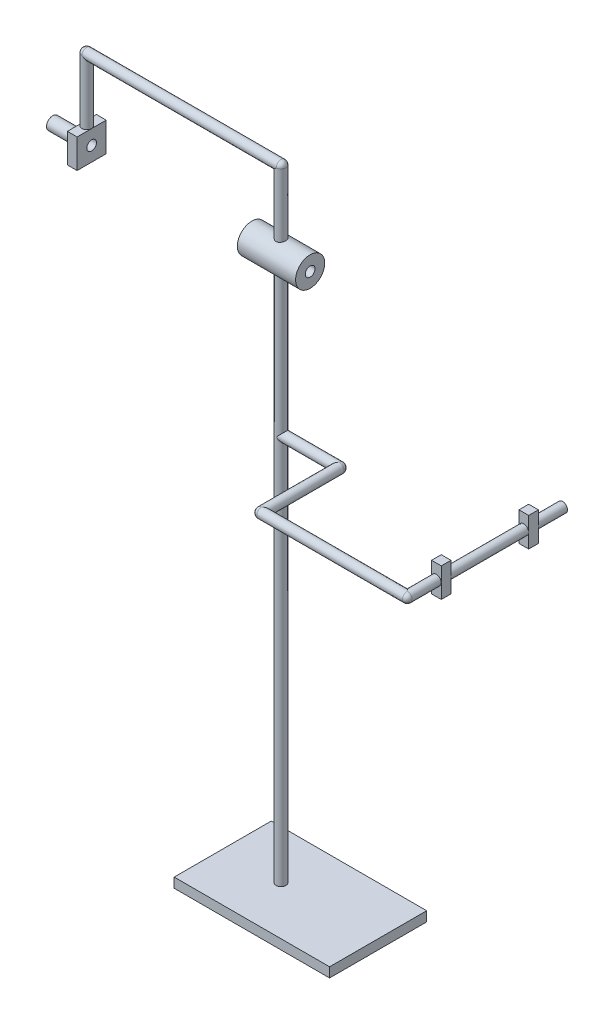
ISO-10303-21;
HEADER;
FILE_DESCRIPTION(('STEP AP214'),'2;1');
FILE_NAME('part.step','',(''),(''),'','','');
FILE_SCHEMA(('AUTOMOTIVE_DESIGN { 1 0 10303 214 1 1 1 1 }'));
ENDSEC;
DATA;
#1=APPLICATION_CONTEXT('core data for automotive mechanical design processes');
#2=APPLICATION_PROTOCOL_DEFINITION('international standard','automotive_design',2000,#1);
#3=PRODUCT_CONTEXT('',#1,'mechanical');
#4=PRODUCT('Part','Part','',(#3));
#5=PRODUCT_RELATED_PRODUCT_CATEGORY('part','',(#4));
#6=PRODUCT_DEFINITION_FORMATION('','',#4);
#7=PRODUCT_DEFINITION_CONTEXT('part definition',#1,'design');
#8=PRODUCT_DEFINITION('design','',#6,#7);
#9=PRODUCT_DEFINITION_SHAPE('','',#8);
#10=(LENGTH_UNIT() NAMED_UNIT(*) SI_UNIT(.MILLI.,.METRE.));
#11=(NAMED_UNIT(*) PLANE_ANGLE_UNIT() SI_UNIT($,.RADIAN.));
#12=(NAMED_UNIT(*) SI_UNIT($,.STERADIAN.) SOLID_ANGLE_UNIT());
#13=UNCERTAINTY_MEASURE_WITH_UNIT(LENGTH_MEASURE(1.E-05),#10,'distance_accuracy_value','');
#14=(GEOMETRIC_REPRESENTATION_CONTEXT(3) GLOBAL_UNCERTAINTY_ASSIGNED_CONTEXT((#13)) GLOBAL_UNIT_ASSIGNED_CONTEXT((#10,
#11,#12)) REPRESENTATION_CONTEXT('',''));
#15=CARTESIAN_POINT('',(0.,0.,0.));
#16=DIRECTION('',(0.,0.,1.));
#17=DIRECTION('',(1.,0.,0.));
#18=AXIS2_PLACEMENT_3D('',#15,#16,#17);
#19=CARTESIAN_POINT('',(30.,0.,40.));
#20=DIRECTION('',(0.,0.,-1.));
#21=DIRECTION('',(-1.,0.,0.));
#22=AXIS2_PLACEMENT_3D('',#19,#20,#21);
#23=CYLINDRICAL_SURFACE('',#22,2.5);
#24=CARTESIAN_POINT('',(30.,0.,0.));
#25=DIRECTION('',(0.,0.,1.));
#26=DIRECTION('',(1.,0.,0.));
#27=AXIS2_PLACEMENT_3D('',#24,#25,#26);
#28=CIRCLE('',#27,2.5);
#29=CARTESIAN_POINT('',(30.,-2.5,0.));
#30=VERTEX_POINT('',#29);
#31=CARTESIAN_POINT('',(30.,2.5,0.));
#32=VERTEX_POINT('',#31);
#33=EDGE_CURVE('E340',#30,#32,#28,.T.);
#34=ORIENTED_EDGE('',*,*,#33,.T.);
#35=CARTESIAN_POINT('',(30.,0.,0.));
#36=DIRECTION('',(-0.707106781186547,0.,-0.707106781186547));
#37=DIRECTION('',(-0.707106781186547,0.,0.707106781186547));
#38=AXIS2_PLACEMENT_3D('',#35,#36,#37);
#39=ELLIPSE('',#38,3.53553390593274,2.5);
#40=EDGE_CURVE('E346',#32,#30,#39,.F.);
#41=ORIENTED_EDGE('',*,*,#40,.T.);
#42=EDGE_LOOP('',(#34,#41));
#43=FACE_BOUND('',#42,.T.);
#44=CARTESIAN_POINT('',(30.,0.,40.));
#45=DIRECTION('',(-0.707106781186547,0.,-0.707106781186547));
#46=DIRECTION('',(0.707106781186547,0.,-0.707106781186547));
#47=AXIS2_PLACEMENT_3D('',#44,#45,#46);
#48=ELLIPSE('',#47,3.53553390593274,2.5);
#49=CARTESIAN_POINT('',(30.,-2.5,40.));
#50=VERTEX_POINT('',#49);
#51=CARTESIAN_POINT('',(30.,2.5,40.));
#52=VERTEX_POINT('',#51);
#53=EDGE_CURVE('E337',#50,#52,#48,.F.);
#54=ORIENTED_EDGE('',*,*,#53,.F.);
#55=CARTESIAN_POINT('',(30.,0.,40.));
#56=DIRECTION('',(0.,0.,1.));
#57=DIRECTION('',(1.,0.,0.));
#58=AXIS2_PLACEMENT_3D('',#55,#56,#57);
#59=CIRCLE('',#58,2.5);
#60=EDGE_CURVE('E343',#52,#50,#59,.T.);
#61=ORIENTED_EDGE('',*,*,#60,.F.);
#62=EDGE_LOOP('',(#54,#61));
#63=FACE_BOUND('',#62,.T.);
#64=ADVANCED_FACE('F28',(#43,#63),#23,.T.);
#65=CARTESIAN_POINT('',(0.,0.,0.));
#66=DIRECTION('',(-1.,0.,0.));
#67=DIRECTION('',(0.,0.,1.));
#68=AXIS2_PLACEMENT_3D('',#65,#66,#67);
#69=CYLINDRICAL_SURFACE('',#68,2.5);
#70=CARTESIAN_POINT('',(0.,0.,0.));
#71=DIRECTION('',(0.707106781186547,-0.707106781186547,0.));
#72=DIRECTION('',(-0.707106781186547,-0.707106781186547,0.));
#73=AXIS2_PLACEMENT_3D('',#70,#71,#72);
#74=ELLIPSE('',#73,3.53553390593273,2.49999999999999);
#75=CARTESIAN_POINT('',(0.,0.,-2.49999999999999));
#76=VERTEX_POINT('',#75);
#77=CARTESIAN_POINT('',(0.,0.,2.49999999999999));
#78=VERTEX_POINT('',#77);
#79=EDGE_CURVE('E976',#76,#78,#74,.T.);
#80=ORIENTED_EDGE('',*,*,#79,.T.);
#81=CARTESIAN_POINT('',(0.,0.,0.));
#82=DIRECTION('',(-0.707106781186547,-0.707106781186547,0.));
#83=DIRECTION('',(0.707106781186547,-0.707106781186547,0.));
#84=AXIS2_PLACEMENT_3D('',#81,#82,#83);
#85=ELLIPSE('',#84,3.53553390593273,2.49999999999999);
#86=EDGE_CURVE('E972',#78,#76,#85,.F.);
#87=ORIENTED_EDGE('',*,*,#86,.T.);
#88=EDGE_LOOP('',(#80,#87));
#89=FACE_BOUND('',#88,.T.);
#90=ORIENTED_EDGE('',*,*,#40,.F.);
#91=CARTESIAN_POINT('',(30.,0.,0.));
#92=DIRECTION('',(-1.,0.,0.));
#93=DIRECTION('',(0.,0.,1.));
#94=AXIS2_PLACEMENT_3D('',#91,#92,#93);
#95=CIRCLE('',#94,2.5);
#96=EDGE_CURVE('E349',#32,#30,#95,.T.);
#97=ORIENTED_EDGE('',*,*,#96,.T.);
#98=EDGE_LOOP('',(#90,#97));
#99=FACE_BOUND('',#98,.T.);
#100=ADVANCED_FACE('F452',(#89,#99),#69,.T.);
#101=CARTESIAN_POINT('',(0.,-100.,0.));
#102=DIRECTION('',(0.,-1.,0.));
#103=DIRECTION('',(0.,0.,-1.));
#104=AXIS2_PLACEMENT_3D('',#101,#102,#103);
#105=CYLINDRICAL_SURFACE('',#104,2.49999999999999);
#106=CARTESIAN_POINT('',(0.,72.9289321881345,-2.49999999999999));
#107=CARTESIAN_POINT('',(-0.136170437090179,72.9289326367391,-2.50000064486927));
#108=CARTESIAN_POINT('',(-0.272336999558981,72.9249557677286,-2.4888369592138));
#109=CARTESIAN_POINT('',(-0.54063605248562,72.9095606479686,-2.44462782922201));
#110=CARTESIAN_POINT('',(-0.672767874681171,72.8981411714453,-2.41157878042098));
#111=CARTESIAN_POINT('',(-0.929067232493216,72.8692949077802,-2.32488871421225));
#112=CARTESIAN_POINT('',(-1.05324982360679,72.851879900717,-2.2712880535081));
#113=CARTESIAN_POINT('',(-1.2909001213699,72.8130219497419,-2.14515407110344));
#114=CARTESIAN_POINT('',(-1.40436545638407,72.7915781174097,-2.07261657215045));
#115=CARTESIAN_POINT('',(-1.62179990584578,72.7461377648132,-1.90762786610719));
#116=CARTESIAN_POINT('',(-1.72528857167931,72.7220776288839,-1.81456085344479));
#117=CARTESIAN_POINT('',(-1.91551700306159,72.6746533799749,-1.61246916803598));
#118=CARTESIAN_POINT('',(-2.00225407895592,72.651289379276,-1.50344193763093));
#119=CARTESIAN_POINT('',(-2.15869724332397,72.607153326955,-1.26901126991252));
#120=CARTESIAN_POINT('',(-2.22789992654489,72.5864648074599,-1.14325477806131));
#121=CARTESIAN_POINT('',(-2.34397896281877,72.5507603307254,-0.881078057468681));
#122=CARTESIAN_POINT('',(-2.39086133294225,72.535742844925,-0.744660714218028));
#123=CARTESIAN_POINT('',(-2.45933963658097,72.5135231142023,-0.470072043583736));
#124=CARTESIAN_POINT('',(-2.48175861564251,72.506067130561,-0.332126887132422));
#125=CARTESIAN_POINT('',(-2.50329073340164,72.4989097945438,-0.0542446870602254));
#126=CARTESIAN_POINT('',(-2.50240987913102,72.4992064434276,0.085691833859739));
#127=CARTESIAN_POINT('',(-2.47788936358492,72.5073490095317,0.357758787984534));
#128=CARTESIAN_POINT('',(-2.45514367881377,72.5148983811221,0.489980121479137));
#129=CARTESIAN_POINT('',(-2.38901754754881,72.5363258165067,0.748608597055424));
#130=CARTESIAN_POINT('',(-2.34563570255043,72.5502043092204,0.875015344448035));
#131=CARTESIAN_POINT('',(-2.23894670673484,72.5831082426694,1.12038118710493));
#132=CARTESIAN_POINT('',(-2.17538515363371,72.6021989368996,1.23922055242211));
#133=CARTESIAN_POINT('',(-2.03035073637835,72.643540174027,1.4648108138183));
#134=CARTESIAN_POINT('',(-1.94887289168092,72.6657915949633,1.57155833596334));
#135=CARTESIAN_POINT('',(-1.76581401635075,72.7123452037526,1.77525216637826));
#136=CARTESIAN_POINT('',(-1.66346710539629,72.7366946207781,1.87150039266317));
#137=CARTESIAN_POINT('',(-1.44387818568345,72.7838166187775,2.04569314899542));
#138=CARTESIAN_POINT('',(-1.32663388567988,72.8065889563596,2.12363485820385));
#139=CARTESIAN_POINT('',(-1.0783659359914,72.8482368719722,2.25996863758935));
#140=CARTESIAN_POINT('',(-0.947169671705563,72.8670522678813,2.31806615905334));
#141=CARTESIAN_POINT('',(-0.676071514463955,72.8979587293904,2.41110798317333));
#142=CARTESIAN_POINT('',(-0.536173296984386,72.9100526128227,2.44606198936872));
#143=CARTESIAN_POINT('',(-0.258404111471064,72.9255090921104,2.49040320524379));
#144=CARTESIAN_POINT('',(-0.12072643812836,72.9292409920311,2.50087273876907));
#145=CARTESIAN_POINT('',(0.154440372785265,72.9285831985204,2.49901359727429));
#146=CARTESIAN_POINT('',(0.291929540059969,72.9241949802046,2.4866890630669));
#147=CARTESIAN_POINT('',(0.55789241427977,72.9081595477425,2.44056412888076));
#148=CARTESIAN_POINT('',(0.686513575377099,72.896766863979,2.4075159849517));
#149=CARTESIAN_POINT('',(0.936359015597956,72.8682861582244,2.32178465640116));
#150=CARTESIAN_POINT('',(1.05758197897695,72.851197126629,2.26909799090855));
#151=CARTESIAN_POINT('',(1.29345105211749,72.8125780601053,2.14368585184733));
#152=CARTESIAN_POINT('',(1.4077666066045,72.7909243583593,2.07037779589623));
#153=CARTESIAN_POINT('',(1.62286513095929,72.7458557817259,1.90646407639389));
#154=CARTESIAN_POINT('',(1.72364409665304,72.7224403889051,1.81585331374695));
#155=CARTESIAN_POINT('',(1.91381996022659,72.6751240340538,1.61472926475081));
#156=CARTESIAN_POINT('',(2.00243597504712,72.6512539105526,1.50346817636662));
#157=CARTESIAN_POINT('',(2.1597903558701,72.6068287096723,1.26706822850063));
#158=CARTESIAN_POINT('',(2.22852942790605,72.5862735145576,1.14192986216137));
#159=CARTESIAN_POINT('',(2.34355026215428,72.5508898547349,0.881949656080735));
#160=CARTESIAN_POINT('',(2.38997819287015,72.5360242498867,0.747177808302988));
#161=CARTESIAN_POINT('',(2.45931935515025,72.5135347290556,0.471146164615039));
#162=CARTESIAN_POINT('',(2.48224107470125,72.5059081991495,0.329888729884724));
#163=CARTESIAN_POINT('',(2.50315519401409,72.4989534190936,0.0520383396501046));
#164=CARTESIAN_POINT('',(2.50226863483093,72.499251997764,-0.0844618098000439));
#165=CARTESIAN_POINT('',(2.47835672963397,72.5071950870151,-0.355277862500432));
#166=CARTESIAN_POINT('',(2.45533317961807,72.5148390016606,-0.489593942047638));
#167=CARTESIAN_POINT('',(2.38854441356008,72.5364771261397,-0.750105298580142));
#168=CARTESIAN_POINT('',(2.34511446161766,72.5503685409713,-0.876395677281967));
#169=CARTESIAN_POINT('',(2.2390561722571,72.5830709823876,-1.11994587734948));
#170=CARTESIAN_POINT('',(2.17642436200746,72.6018828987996,-1.23720406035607));
#171=CARTESIAN_POINT('',(2.03107621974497,72.643353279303,-1.46408504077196));
#172=CARTESIAN_POINT('',(1.94770328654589,72.6661281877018,-1.57326562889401));
#173=CARTESIAN_POINT('',(1.76435652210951,72.712675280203,-1.77645256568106));
#174=CARTESIAN_POINT('',(1.66437739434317,72.7364477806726,-1.87045405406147));
#175=CARTESIAN_POINT('',(1.44597661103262,72.78341800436,-2.04435452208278));
#176=CARTESIAN_POINT('',(1.3269862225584,72.8065568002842,-2.12355741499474));
#177=CARTESIAN_POINT('',(1.07666393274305,72.8484951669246,-2.26078585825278));
#178=CARTESIAN_POINT('',(0.945335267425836,72.8672958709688,-2.31881694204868));
#179=CARTESIAN_POINT('',(0.680095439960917,72.8974666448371,-2.4096095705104));
#180=CARTESIAN_POINT('',(0.546569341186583,72.9091341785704,-2.44339477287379));
#181=CARTESIAN_POINT('',(0.275359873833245,72.9248654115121,-2.48858580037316));
#182=CARTESIAN_POINT('',(0.137677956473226,72.9289317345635,-2.49999934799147));
#183=CARTESIAN_POINT('',(0.,72.9289321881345,-2.49999999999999));
#184=B_SPLINE_CURVE_WITH_KNOTS('',3,(#106,#107,#108,#109,#110,#111,#112,#113,#114,#115,#116,
#117,#118,#119,#120,#121,#122,#123,#124,#125,#126,#127,#128,#129,#130,#131,#132,#133,#134,#135,
#136,#137,#138,#139,#140,#141,#142,#143,#144,#145,#146,#147,#148,#149,#150,#151,#152,#153,#154,
#155,#156,#157,#158,#159,#160,#161,#162,#163,#164,#165,#166,#167,#168,#169,#170,#171,#172,#173,
#174,#175,#176,#177,#178,#179,#180,#181,#182,#183),.UNSPECIFIED.,.T.,.F.,(4,2,2,2,2,2,2,2,2,2,2,
2,2,2,2,2,2,2,2,2,2,2,2,2,2,2,2,2,2,2,2,2,2,2,2,2,2,2,4),(0.,0.408001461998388,
0.816070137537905,1.22334156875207,1.6307029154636,2.05253343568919,2.47443162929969,
2.90733765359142,3.34012690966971,3.75785796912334,4.17548133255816,4.5767251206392,
4.97799610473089,5.38454137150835,5.79119979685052,6.21700435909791,6.64287449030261,
7.07481599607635,7.50657628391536,7.91885728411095,8.3310633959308,8.72910989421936,
9.1272269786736,9.53797144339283,9.94883714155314,10.3794702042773,10.8100879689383,
11.2378447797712,11.6654470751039,12.0729521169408,12.4804241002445,12.8814239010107,
13.282496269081,13.6983879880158,14.1144126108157,14.5467225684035,14.9789194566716,
15.3915803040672,15.8040986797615),.UNSPECIFIED.);
#185=CARTESIAN_POINT('',(0.,72.9289321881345,-2.49999999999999));
#186=VERTEX_POINT('',#185);
#187=EDGE_CURVE('E421',#186,#186,#184,.T.);
#188=ORIENTED_EDGE('',*,*,#187,.F.);
#189=EDGE_LOOP('',(#188));
#190=FACE_BOUND('',#189,.T.);
#191=ORIENTED_EDGE('',*,*,#86,.F.);
#192=ORIENTED_EDGE('',*,*,#79,.F.);
#193=EDGE_LOOP('',(#191,#192));
#194=FACE_BOUND('',#193,.T.);
#195=CARTESIAN_POINT('',(0.,-200.,0.));
#196=DIRECTION('',(0.,-1.,0.));
#197=DIRECTION('',(0.,0.,-1.));
#198=AXIS2_PLACEMENT_3D('',#195,#196,#197);
#199=CIRCLE('',#198,2.49999999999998);
#200=CARTESIAN_POINT('',(0.,-200.,-2.49999999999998));
#201=VERTEX_POINT('',#200);
#202=EDGE_CURVE('E320',#201,#201,#199,.T.);
#203=ORIENTED_EDGE('',*,*,#202,.F.);
#204=EDGE_LOOP('',(#203));
#205=FACE_BOUND('',#204,.T.);
#206=ADVANCED_FACE('F30',(#190,#194,#205),#105,.T.);
#207=CARTESIAN_POINT('',(-102.5,72.5,7.5));
#208=DIRECTION('',(1.,0.,0.));
#209=DIRECTION('',(0.,0.,-1.));
#210=AXIS2_PLACEMENT_3D('',#207,#208,#209);
#211=PLANE('',#210);
#212=DIRECTION('',(0.,0.,-1.));
#213=VECTOR('',#212,1.);
#214=CARTESIAN_POINT('',(-102.5,87.5,7.5));
#215=LINE('',#214,#213);
#216=CARTESIAN_POINT('',(-102.5,87.5,7.5));
#217=VERTEX_POINT('',#216);
#218=CARTESIAN_POINT('',(-102.5,87.5,0.));
#219=VERTEX_POINT('',#218);
#220=EDGE_CURVE('E367',#217,#219,#215,.T.);
#221=ORIENTED_EDGE('',*,*,#220,.T.);
#222=CARTESIAN_POINT('',(-102.5,87.5,-7.5));
#223=VERTEX_POINT('',#222);
#224=EDGE_CURVE('E366',#219,#223,#215,.T.);
#225=ORIENTED_EDGE('',*,*,#224,.T.);
#226=DIRECTION('',(0.,1.,0.));
#227=VECTOR('',#226,1.);
#228=CARTESIAN_POINT('',(-102.5,72.5,-7.5));
#229=LINE('',#228,#227);
#230=CARTESIAN_POINT('',(-102.5,72.5,-7.5));
#231=VERTEX_POINT('',#230);
#232=EDGE_CURVE('E384',#231,#223,#229,.T.);
#233=ORIENTED_EDGE('',*,*,#232,.F.);
#234=DIRECTION('',(0.,0.,-1.));
#235=VECTOR('',#234,1.);
#236=CARTESIAN_POINT('',(-102.5,72.5,7.5));
#237=LINE('',#236,#235);
#238=CARTESIAN_POINT('',(-102.5,72.5,7.5));
#239=VERTEX_POINT('',#238);
#240=EDGE_CURVE('E377',#239,#231,#237,.T.);
#241=ORIENTED_EDGE('',*,*,#240,.F.);
#242=DIRECTION('',(0.,1.,0.));
#243=VECTOR('',#242,1.);
#244=CARTESIAN_POINT('',(-102.5,72.5,7.5));
#245=LINE('',#244,#243);
#246=EDGE_CURVE('E387',#239,#217,#245,.T.);
#247=ORIENTED_EDGE('',*,*,#246,.T.);
#248=EDGE_LOOP('',(#221,#225,#233,#241,#247));
#249=FACE_BOUND('',#248,.T.);
#250=CARTESIAN_POINT('',(-102.5,80.,0.));
#251=DIRECTION('',(1.,0.,0.));
#252=DIRECTION('',(0.,0.,-1.));
#253=AXIS2_PLACEMENT_3D('',#250,#251,#252);
#254=CIRCLE('',#253,3.25);
#255=CARTESIAN_POINT('',(-102.5,80.,-3.25));
#256=VERTEX_POINT('',#255);
#257=EDGE_CURVE('E420',#256,#256,#254,.F.);
#258=ORIENTED_EDGE('',*,*,#257,.F.);
#259=EDGE_LOOP('',(#258));
#260=FACE_BOUND('',#259,.T.);
#261=ADVANCED_FACE('F492',(#249,#260),#211,.F.);
#262=CARTESIAN_POINT('',(-100.,120.,0.));
#263=DIRECTION('',(1.,0.,0.));
#264=DIRECTION('',(0.,0.,-1.));
#265=AXIS2_PLACEMENT_3D('',#262,#263,#264);
#266=CYLINDRICAL_SURFACE('',#265,2.5);
#267=CARTESIAN_POINT('',(0.,120.,0.));
#268=DIRECTION('',(0.707106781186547,-0.707106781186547,0.));
#269=DIRECTION('',(-0.707106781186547,-0.707106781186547,0.));
#270=AXIS2_PLACEMENT_3D('',#267,#268,#269);
#271=ELLIPSE('',#270,3.53553390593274,2.5);
#272=CARTESIAN_POINT('',(0.,120.,2.5));
#273=VERTEX_POINT('',#272);
#274=CARTESIAN_POINT('',(0.,120.,-2.5));
#275=VERTEX_POINT('',#274);
#276=EDGE_CURVE('E408',#273,#275,#271,.T.);
#277=ORIENTED_EDGE('',*,*,#276,.F.);
#278=CARTESIAN_POINT('',(0.,120.,0.));
#279=DIRECTION('',(1.,0.,0.));
#280=DIRECTION('',(0.,0.,-1.));
#281=AXIS2_PLACEMENT_3D('',#278,#279,#280);
#282=CIRCLE('',#281,2.5);
#283=EDGE_CURVE('E402',#275,#273,#282,.T.);
#284=ORIENTED_EDGE('',*,*,#283,.F.);
#285=EDGE_LOOP('',(#277,#284));
#286=FACE_BOUND('',#285,.T.);
#287=CARTESIAN_POINT('',(-100.,120.,0.));
#288=DIRECTION('',(1.,0.,0.));
#289=DIRECTION('',(0.,0.,-1.));
#290=AXIS2_PLACEMENT_3D('',#287,#288,#289);
#291=CIRCLE('',#290,2.5);
#292=CARTESIAN_POINT('',(-100.,120.,-2.49999999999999));
#293=VERTEX_POINT('',#292);
#294=CARTESIAN_POINT('',(-100.,120.,2.49999999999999));
#295=VERTEX_POINT('',#294);
#296=EDGE_CURVE('E405',#293,#295,#291,.T.);
#297=ORIENTED_EDGE('',*,*,#296,.T.);
#298=CARTESIAN_POINT('',(-100.,120.,0.));
#299=DIRECTION('',(0.707106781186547,0.707106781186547,0.));
#300=DIRECTION('',(0.707106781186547,-0.707106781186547,0.));
#301=AXIS2_PLACEMENT_3D('',#298,#299,#300);
#302=ELLIPSE('',#301,3.53553390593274,2.5);
#303=EDGE_CURVE('E400',#295,#293,#302,.T.);
#304=ORIENTED_EDGE('',*,*,#303,.T.);
#305=EDGE_LOOP('',(#297,#304));
#306=FACE_BOUND('',#305,.T.);
#307=ADVANCED_FACE('F434',(#286,#306),#266,.T.);
#308=CARTESIAN_POINT('',(15.,80.,0.));
#309=DIRECTION('',(-1.,0.,0.));
#310=DIRECTION('',(0.,0.,1.));
#311=AXIS2_PLACEMENT_3D('',#308,#309,#310);
#312=CYLINDRICAL_SURFACE('',#311,7.5);
#313=ORIENTED_EDGE('',*,*,#187,.T.);
#314=EDGE_LOOP('',(#313));
#315=FACE_BOUND('',#314,.T.);
#316=CARTESIAN_POINT('',(15.,80.,0.));
#317=DIRECTION('',(1.,0.,0.));
#318=DIRECTION('',(0.,0.,-1.));
#319=AXIS2_PLACEMENT_3D('',#316,#317,#318);
#320=CIRCLE('',#319,7.5);
#321=CARTESIAN_POINT('',(15.,80.,-7.5));
#322=VERTEX_POINT('',#321);
#323=EDGE_CURVE('E1027',#322,#322,#320,.T.);
#324=ORIENTED_EDGE('',*,*,#323,.F.);
#325=EDGE_LOOP('',(#324));
#326=FACE_BOUND('',#325,.T.);
#327=CARTESIAN_POINT('',(-15.,80.,0.));
#328=DIRECTION('',(1.,0.,0.));
#329=DIRECTION('',(0.,0.,-1.));
#330=AXIS2_PLACEMENT_3D('',#327,#328,#329);
#331=CIRCLE('',#330,7.5);
#332=CARTESIAN_POINT('',(-15.,80.,-7.5));
#333=VERTEX_POINT('',#332);
#334=EDGE_CURVE('E1030',#333,#333,#331,.T.);
#335=ORIENTED_EDGE('',*,*,#334,.T.);
#336=EDGE_LOOP('',(#335));
#337=FACE_BOUND('',#336,.T.);
#338=CARTESIAN_POINT('',(2.5,87.5,0.));
#339=CARTESIAN_POINT('',(2.5000006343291,87.5000003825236,-0.136408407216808));
#340=CARTESIAN_POINT('',(2.48879933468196,87.4962442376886,-0.272812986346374));
#341=CARTESIAN_POINT('',(2.44442722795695,87.481630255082,-0.54160440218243));
#342=CARTESIAN_POINT('',(2.41125414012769,87.4707716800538,-0.673990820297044));
#343=CARTESIAN_POINT('',(2.32420189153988,87.4431326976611,-0.930831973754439));
#344=CARTESIAN_POINT('',(2.27035734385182,87.4263621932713,-1.05529956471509));
#345=CARTESIAN_POINT('',(2.14364706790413,87.3886111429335,-1.29343734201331));
#346=CARTESIAN_POINT('',(2.0707775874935,87.3676297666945,-1.40710539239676));
#347=CARTESIAN_POINT('',(1.90543548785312,87.3228523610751,-1.62435418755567));
#348=CARTESIAN_POINT('',(1.81242191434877,87.2989889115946,-1.72750925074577));
#349=CARTESIAN_POINT('',(1.61058211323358,87.251507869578,-1.91708173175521));
#350=CARTESIAN_POINT('',(1.50175241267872,87.2278903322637,-2.00349546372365));
#351=CARTESIAN_POINT('',(1.26753721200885,87.1828333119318,-2.15956235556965));
#352=CARTESIAN_POINT('',(1.14176565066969,87.1614759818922,-2.22866214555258));
#353=CARTESIAN_POINT('',(0.879559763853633,87.124382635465,-2.3445471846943));
#354=CARTESIAN_POINT('',(0.743128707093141,87.1086449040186,-2.39133924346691));
#355=CARTESIAN_POINT('',(0.468316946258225,87.0852825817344,-2.45968365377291));
#356=CARTESIAN_POINT('',(0.33015697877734,87.0774023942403,-2.48203362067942));
#357=CARTESIAN_POINT('',(0.0518406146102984,87.0698914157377,-2.50335280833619));
#358=CARTESIAN_POINT('',(-0.0883151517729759,87.0702580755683,-2.50232925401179));
#359=CARTESIAN_POINT('',(-0.359841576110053,87.0789753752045,-2.47754975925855));
#360=CARTESIAN_POINT('',(-0.491321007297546,87.0869603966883,-2.45483478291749));
#361=CARTESIAN_POINT('',(-0.748483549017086,87.1094164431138,-2.38901540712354));
#362=CARTESIAN_POINT('',(-0.874165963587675,87.1238882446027,-2.34590856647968));
#363=CARTESIAN_POINT('',(-1.1185318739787,87.1579477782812,-2.23984764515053));
#364=CARTESIAN_POINT('',(-1.23707006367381,87.1776141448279,-2.17658512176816));
#365=CARTESIAN_POINT('',(-1.46217727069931,87.2198139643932,-2.03222276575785));
#366=CARTESIAN_POINT('',(-1.56874281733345,87.2423482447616,-1.95111778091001));
#367=CARTESIAN_POINT('',(-1.77272899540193,87.2891832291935,-1.76837333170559));
#368=CARTESIAN_POINT('',(-1.86938173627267,87.3135147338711,-1.66588287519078));
#369=CARTESIAN_POINT('',(-2.04432816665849,87.3601734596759,-1.44584892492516));
#370=CARTESIAN_POINT('',(-2.12262009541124,87.3825004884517,-1.32830398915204));
#371=CARTESIAN_POINT('',(-2.25924075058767,87.4229276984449,-1.07986903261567));
#372=CARTESIAN_POINT('',(-2.31736372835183,87.440983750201,-0.948858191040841));
#373=CARTESIAN_POINT('',(-2.41050793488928,87.4705141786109,-0.678172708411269));
#374=CARTESIAN_POINT('',(-2.44553718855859,87.481990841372,-0.538501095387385));
#375=CARTESIAN_POINT('',(-2.4901391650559,87.496690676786,-0.260959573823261));
#376=CARTESIAN_POINT('',(-2.50074952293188,87.5002500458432,-0.123273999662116));
#377=CARTESIAN_POINT('',(-2.49916831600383,87.4997225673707,0.151937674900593));
#378=CARTESIAN_POINT('',(-2.48698060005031,87.4956370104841,0.289463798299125));
#379=CARTESIAN_POINT('',(-2.4409702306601,87.4805006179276,0.556299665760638));
#380=CARTESIAN_POINT('',(-2.40778448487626,87.4696549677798,0.685732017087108));
#381=CARTESIAN_POINT('',(-2.32151638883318,87.4422961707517,0.937139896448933));
#382=CARTESIAN_POINT('',(-2.26843150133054,87.4257823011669,1.05911447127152));
#383=CARTESIAN_POINT('',(-2.14232392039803,87.3882232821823,1.29572074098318));
#384=CARTESIAN_POINT('',(-2.06881351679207,87.3670703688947,1.41007489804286));
#385=CARTESIAN_POINT('',(-1.90451462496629,87.3226313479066,1.62516207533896));
#386=CARTESIAN_POINT('',(-1.81372085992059,87.2993445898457,1.72589091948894));
#387=CARTESIAN_POINT('',(-1.61255312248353,87.2519211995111,1.91563126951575));
#388=CARTESIAN_POINT('',(-1.50147693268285,87.2277940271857,2.00390242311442));
#389=CARTESIAN_POINT('',(-1.26557108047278,87.1824993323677,2.16064380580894));
#390=CARTESIAN_POINT('',(-1.14074130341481,87.1613318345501,2.22911386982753));
#391=CARTESIAN_POINT('',(-0.880817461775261,87.1245597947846,2.3439923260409));
#392=CARTESIAN_POINT('',(-0.745744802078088,87.1089440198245,2.39044533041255));
#393=CARTESIAN_POINT('',(-0.469053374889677,87.0852708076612,2.45973666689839));
#394=CARTESIAN_POINT('',(-0.327437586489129,87.077209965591,2.48258563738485));
#395=CARTESIAN_POINT('',(-0.0495072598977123,87.0699464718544,2.50319070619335));
#396=CARTESIAN_POINT('',(0.0867058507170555,87.0703100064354,2.502175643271));
#397=CARTESIAN_POINT('',(0.356912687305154,87.0787817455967,2.47810573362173));
#398=CARTESIAN_POINT('',(0.49090654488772,87.086889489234,2.45505219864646));
#399=CARTESIAN_POINT('',(0.750339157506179,87.1096131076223,2.38842953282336));
#400=CARTESIAN_POINT('',(0.875892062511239,87.1241024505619,2.34525836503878));
#401=CARTESIAN_POINT('',(1.11806851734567,87.1579099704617,2.23994841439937));
#402=CARTESIAN_POINT('',(1.23469007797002,87.1772292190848,2.17780542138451));
#403=CARTESIAN_POINT('',(1.46120917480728,87.2195707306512,2.03315173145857));
#404=CARTESIAN_POINT('',(1.57059125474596,87.2427177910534,1.94987060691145));
#405=CARTESIAN_POINT('',(1.7742245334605,87.2895839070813,1.76660720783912));
#406=CARTESIAN_POINT('',(1.86847143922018,87.3133031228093,1.6666202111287));
#407=CARTESIAN_POINT('',(2.04286103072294,87.3597507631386,1.44810389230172));
#408=CARTESIAN_POINT('',(2.1223108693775,87.3824045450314,1.32900378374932));
#409=CARTESIAN_POINT('',(2.25997607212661,87.4231497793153,1.07839339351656));
#410=CARTESIAN_POINT('',(2.3181968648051,87.4412423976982,0.946886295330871));
#411=CARTESIAN_POINT('',(2.40930408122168,87.4701378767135,0.681234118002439));
#412=CARTESIAN_POINT('',(2.44320616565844,87.4812303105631,0.547469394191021));
#413=CARTESIAN_POINT('',(2.48855070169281,87.4961601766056,0.275801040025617));
#414=CARTESIAN_POINT('',(2.49999935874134,87.4999996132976,0.137898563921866));
#415=CARTESIAN_POINT('',(2.5,87.5,0.));
#416=B_SPLINE_CURVE_WITH_KNOTS('',3,(#338,#339,#340,#341,#342,#343,#344,#345,#346,#347,#348,
#349,#350,#351,#352,#353,#354,#355,#356,#357,#358,#359,#360,#361,#362,#363,#364,#365,#366,#367,
#368,#369,#370,#371,#372,#373,#374,#375,#376,#377,#378,#379,#380,#381,#382,#383,#384,#385,#386,
#387,#388,#389,#390,#391,#392,#393,#394,#395,#396,#397,#398,#399,#400,#401,#402,#403,#404,#405,
#406,#407,#408,#409,#410,#411,#412,#413,#414,#415),.UNSPECIFIED.,.T.,.F.,(4,2,2,2,2,2,2,2,2,2,2,
2,2,2,2,2,2,2,2,2,2,2,2,2,2,2,2,2,2,2,2,2,2,2,2,2,2,2,4),(0.,0.408717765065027,
0.817477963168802,1.22555668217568,1.63371594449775,2.0546171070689,2.47561083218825,
2.90870962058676,3.34167611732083,3.760048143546,4.17829084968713,4.577420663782,
4.97659827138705,5.38220427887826,5.78792756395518,6.21483264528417,6.64177864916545,
7.07296014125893,7.5039917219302,7.91633957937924,8.32861782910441,8.72895394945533,
9.12934113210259,9.5402599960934,9.95130452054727,10.3810255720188,10.8107502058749,
11.2396003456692,11.668257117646,12.0748916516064,12.4815019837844,12.8803896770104,
13.2793659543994,13.6957516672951,14.1122552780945,14.5449915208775,14.9776170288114,
15.3909139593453,15.8040966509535),.UNSPECIFIED.);
#417=CARTESIAN_POINT('',(2.5,87.5,0.));
#418=VERTEX_POINT('',#417);
#419=EDGE_CURVE('E414',#418,#418,#416,.T.);
#420=ORIENTED_EDGE('',*,*,#419,.F.);
#421=EDGE_LOOP('',(#420));
#422=FACE_BOUND('',#421,.T.);
#423=ADVANCED_FACE('F423',(#315,#326,#337,#422),#312,.T.);
#424=CARTESIAN_POINT('',(15.,80.,0.));
#425=DIRECTION('',(1.,0.,0.));
#426=DIRECTION('',(0.,0.,-1.));
#427=AXIS2_PLACEMENT_3D('',#424,#425,#426);
#428=PLANE('',#427);
#429=CARTESIAN_POINT('',(15.,80.,0.));
#430=DIRECTION('',(1.,0.,0.));
#431=DIRECTION('',(0.,0.,-1.));
#432=AXIS2_PLACEMENT_3D('',#429,#430,#431);
#433=CIRCLE('',#432,2.5);
#434=CARTESIAN_POINT('',(15.,80.,-2.5));
#435=VERTEX_POINT('',#434);
#436=EDGE_CURVE('E413',#435,#435,#433,.T.);
#437=ORIENTED_EDGE('',*,*,#436,.F.);
#438=EDGE_LOOP('',(#437));
#439=FACE_BOUND('',#438,.T.);
#440=ORIENTED_EDGE('',*,*,#323,.T.);
#441=EDGE_LOOP('',(#440));
#442=FACE_BOUND('',#441,.T.);
#443=ADVANCED_FACE('F441',(#439,#442),#428,.T.);
#444=CARTESIAN_POINT('',(-15.,80.,0.));
#445=DIRECTION('',(1.,0.,0.));
#446=DIRECTION('',(0.,0.,-1.));
#447=AXIS2_PLACEMENT_3D('',#444,#445,#446);
#448=PLANE('',#447);
#449=CARTESIAN_POINT('',(-15.,80.,0.));
#450=DIRECTION('',(1.,0.,0.));
#451=DIRECTION('',(0.,0.,-1.));
#452=AXIS2_PLACEMENT_3D('',#449,#450,#451);
#453=CIRCLE('',#452,2.5);
#454=CARTESIAN_POINT('',(-15.,80.,-2.5));
#455=VERTEX_POINT('',#454);
#456=EDGE_CURVE('E1032',#455,#455,#453,.T.);
#457=ORIENTED_EDGE('',*,*,#456,.T.);
#458=EDGE_LOOP('',(#457));
#459=FACE_BOUND('',#458,.T.);
#460=ORIENTED_EDGE('',*,*,#334,.F.);
#461=EDGE_LOOP('',(#460));
#462=FACE_BOUND('',#461,.T.);
#463=ADVANCED_FACE('F438',(#459,#462),#448,.F.);
#464=CARTESIAN_POINT('',(-15.,80.,0.));
#465=DIRECTION('',(1.,0.,0.));
#466=DIRECTION('',(0.,0.,-1.));
#467=AXIS2_PLACEMENT_3D('',#464,#465,#466);
#468=CYLINDRICAL_SURFACE('',#467,2.5);
#469=ORIENTED_EDGE('',*,*,#456,.F.);
#470=EDGE_LOOP('',(#469));
#471=FACE_BOUND('',#470,.T.);
#472=ORIENTED_EDGE('',*,*,#436,.T.);
#473=EDGE_LOOP('',(#472));
#474=FACE_BOUND('',#473,.T.);
#475=ADVANCED_FACE('F432',(#471,#474),#468,.F.);
#476=CARTESIAN_POINT('',(0.,70.,0.));
#477=DIRECTION('',(0.,-1.,0.));
#478=DIRECTION('',(1.,0.,0.));
#479=AXIS2_PLACEMENT_3D('',#476,#477,#478);
#480=CYLINDRICAL_SURFACE('',#479,2.5);
#481=CARTESIAN_POINT('',(0.,120.,0.));
#482=DIRECTION('',(0.,-1.,0.));
#483=DIRECTION('',(1.,0.,0.));
#484=AXIS2_PLACEMENT_3D('',#481,#482,#483);
#485=CIRCLE('',#484,2.5);
#486=EDGE_CURVE('E411',#275,#273,#485,.T.);
#487=ORIENTED_EDGE('',*,*,#486,.T.);
#488=ORIENTED_EDGE('',*,*,#276,.T.);
#489=EDGE_LOOP('',(#487,#488));
#490=FACE_BOUND('',#489,.T.);
#491=ORIENTED_EDGE('',*,*,#419,.T.);
#492=EDGE_LOOP('',(#491));
#493=FACE_BOUND('',#492,.T.);
#494=ADVANCED_FACE('F426',(#490,#493),#480,.T.);
#495=CARTESIAN_POINT('',(0.,120.,0.));
#496=DIRECTION('',(0.,0.,1.));
#497=DIRECTION('',(0.,1.,0.));
#498=AXIS2_PLACEMENT_3D('',#495,#496,#497);
#499=SPHERICAL_SURFACE('',#498,2.5);
#500=ORIENTED_EDGE('',*,*,#283,.T.);
#501=ORIENTED_EDGE('',*,*,#486,.F.);
#502=EDGE_LOOP('',(#500,#501));
#503=FACE_BOUND('',#502,.T.);
#504=ADVANCED_FACE('F431',(#503),#499,.T.);
#505=CARTESIAN_POINT('',(-100.,120.,0.));
#506=DIRECTION('',(0.,1.,0.));
#507=DIRECTION('',(0.,0.,1.));
#508=AXIS2_PLACEMENT_3D('',#505,#506,#507);
#509=CYLINDRICAL_SURFACE('',#508,2.5);
#510=ORIENTED_EDGE('',*,*,#303,.F.);
#511=CARTESIAN_POINT('',(-100.,120.,0.));
#512=DIRECTION('',(0.,1.,0.));
#513=DIRECTION('',(0.,0.,1.));
#514=AXIS2_PLACEMENT_3D('',#511,#512,#513);
#515=CIRCLE('',#514,2.49999999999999);
#516=EDGE_CURVE('E397',#293,#295,#515,.T.);
#517=ORIENTED_EDGE('',*,*,#516,.F.);
#518=EDGE_LOOP('',(#510,#517));
#519=FACE_BOUND('',#518,.T.);
#520=CARTESIAN_POINT('',(-100.,87.5,0.));
#521=DIRECTION('',(0.,1.,0.));
#522=DIRECTION('',(0.,0.,1.));
#523=AXIS2_PLACEMENT_3D('',#520,#521,#522);
#524=CIRCLE('',#523,2.5);
#525=CARTESIAN_POINT('',(-97.5,87.5,0.));
#526=VERTEX_POINT('',#525);
#527=EDGE_CURVE('E394',#526,#219,#524,.T.);
#528=ORIENTED_EDGE('',*,*,#527,.T.);
#529=EDGE_CURVE('E393',#219,#526,#524,.T.);
#530=ORIENTED_EDGE('',*,*,#529,.T.);
#531=EDGE_LOOP('',(#528,#530));
#532=FACE_BOUND('',#531,.T.);
#533=ADVANCED_FACE('F505',(#519,#532),#509,.T.);
#534=CARTESIAN_POINT('',(-100.,120.,0.));
#535=DIRECTION('',(0.,0.,1.));
#536=DIRECTION('',(-1.,0.,0.));
#537=AXIS2_PLACEMENT_3D('',#534,#535,#536);
#538=SPHERICAL_SURFACE('',#537,2.49999999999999);
#539=ORIENTED_EDGE('',*,*,#516,.T.);
#540=ORIENTED_EDGE('',*,*,#296,.F.);
#541=EDGE_LOOP('',(#539,#540));
#542=FACE_BOUND('',#541,.T.);
#543=ADVANCED_FACE('F482',(#542),#538,.T.);
#544=CARTESIAN_POINT('',(-97.5,87.5,-7.5));
#545=DIRECTION('',(0.,1.,0.));
#546=DIRECTION('',(0.,0.,1.));
#547=AXIS2_PLACEMENT_3D('',#544,#545,#546);
#548=PLANE('',#547);
#549=ORIENTED_EDGE('',*,*,#527,.F.);
#550=DIRECTION('',(0.,0.,1.));
#551=VECTOR('',#550,1.);
#552=CARTESIAN_POINT('',(-97.5,87.5,7.5));
#553=LINE('',#552,#551);
#554=CARTESIAN_POINT('',(-97.5,87.5,-7.5));
#555=VERTEX_POINT('',#554);
#556=EDGE_CURVE('E362',#555,#526,#553,.T.);
#557=ORIENTED_EDGE('',*,*,#556,.F.);
#558=DIRECTION('',(1.,0.,0.));
#559=VECTOR('',#558,1.);
#560=CARTESIAN_POINT('',(-97.5,87.5,-7.5));
#561=LINE('',#560,#559);
#562=EDGE_CURVE('E370',#223,#555,#561,.T.);
#563=ORIENTED_EDGE('',*,*,#562,.F.);
#564=ORIENTED_EDGE('',*,*,#224,.F.);
#565=EDGE_LOOP('',(#549,#557,#563,#564));
#566=FACE_BOUND('',#565,.T.);
#567=ADVANCED_FACE('F478',(#566),#548,.T.);
#568=ORIENTED_EDGE('',*,*,#529,.F.);
#569=ORIENTED_EDGE('',*,*,#220,.F.);
#570=DIRECTION('',(-1.,0.,0.));
#571=VECTOR('',#570,1.);
#572=CARTESIAN_POINT('',(-97.5,87.5,7.5));
#573=LINE('',#572,#571);
#574=CARTESIAN_POINT('',(-97.5,87.5,7.5));
#575=VERTEX_POINT('',#574);
#576=EDGE_CURVE('E364',#575,#217,#573,.T.);
#577=ORIENTED_EDGE('',*,*,#576,.F.);
#578=EDGE_CURVE('E361',#526,#575,#553,.T.);
#579=ORIENTED_EDGE('',*,*,#578,.F.);
#580=EDGE_LOOP('',(#568,#569,#577,#579));
#581=FACE_BOUND('',#580,.T.);
#582=ADVANCED_FACE('F481',(#581),#548,.T.);
#583=CARTESIAN_POINT('',(-97.5,72.5,7.5));
#584=DIRECTION('',(-1.,0.,0.));
#585=DIRECTION('',(0.,0.,1.));
#586=AXIS2_PLACEMENT_3D('',#583,#584,#585);
#587=PLANE('',#586);
#588=CARTESIAN_POINT('',(-97.5,80.,0.));
#589=DIRECTION('',(1.,0.,0.));
#590=DIRECTION('',(0.,0.,-1.));
#591=AXIS2_PLACEMENT_3D('',#588,#589,#590);
#592=CIRCLE('',#591,2.5);
#593=CARTESIAN_POINT('',(-97.5,80.,-2.5));
#594=VERTEX_POINT('',#593);
#595=EDGE_CURVE('E358',#594,#594,#592,.T.);
#596=ORIENTED_EDGE('',*,*,#595,.F.);
#597=EDGE_LOOP('',(#596));
#598=FACE_BOUND('',#597,.T.);
#599=ORIENTED_EDGE('',*,*,#556,.T.);
#600=ORIENTED_EDGE('',*,*,#578,.T.);
#601=DIRECTION('',(0.,1.,0.));
#602=VECTOR('',#601,1.);
#603=CARTESIAN_POINT('',(-97.5,72.5,7.5));
#604=LINE('',#603,#602);
#605=CARTESIAN_POINT('',(-97.5,72.5,7.5));
#606=VERTEX_POINT('',#605);
#607=EDGE_CURVE('E390',#606,#575,#604,.T.);
#608=ORIENTED_EDGE('',*,*,#607,.F.);
#609=DIRECTION('',(0.,0.,1.));
#610=VECTOR('',#609,1.);
#611=CARTESIAN_POINT('',(-97.5,72.5,7.5));
#612=LINE('',#611,#610);
#613=CARTESIAN_POINT('',(-97.5,72.5,-7.5));
#614=VERTEX_POINT('',#613);
#615=EDGE_CURVE('E372',#614,#606,#612,.T.);
#616=ORIENTED_EDGE('',*,*,#615,.F.);
#617=DIRECTION('',(0.,1.,0.));
#618=VECTOR('',#617,1.);
#619=CARTESIAN_POINT('',(-97.5,72.5,-7.5));
#620=LINE('',#619,#618);
#621=EDGE_CURVE('E381',#614,#555,#620,.T.);
#622=ORIENTED_EDGE('',*,*,#621,.T.);
#623=EDGE_LOOP('',(#599,#600,#608,#616,#622));
#624=FACE_BOUND('',#623,.T.);
#625=ADVANCED_FACE('F498',(#598,#624),#587,.F.);
#626=CARTESIAN_POINT('',(-97.5,72.5,7.5));
#627=DIRECTION('',(0.,0.,-1.));
#628=DIRECTION('',(-1.,0.,0.));
#629=AXIS2_PLACEMENT_3D('',#626,#627,#628);
#630=PLANE('',#629);
#631=ORIENTED_EDGE('',*,*,#576,.T.);
#632=ORIENTED_EDGE('',*,*,#246,.F.);
#633=DIRECTION('',(-1.,0.,0.));
#634=VECTOR('',#633,1.);
#635=CARTESIAN_POINT('',(-97.5,72.5,7.5));
#636=LINE('',#635,#634);
#637=EDGE_CURVE('E375',#606,#239,#636,.T.);
#638=ORIENTED_EDGE('',*,*,#637,.F.);
#639=ORIENTED_EDGE('',*,*,#607,.T.);
#640=EDGE_LOOP('',(#631,#632,#638,#639));
#641=FACE_BOUND('',#640,.T.);
#642=ADVANCED_FACE('F490',(#641),#630,.F.);
#643=CARTESIAN_POINT('',(-97.5,72.5,-7.5));
#644=DIRECTION('',(0.,0.,1.));
#645=DIRECTION('',(1.,0.,0.));
#646=AXIS2_PLACEMENT_3D('',#643,#644,#645);
#647=PLANE('',#646);
#648=ORIENTED_EDGE('',*,*,#562,.T.);
#649=ORIENTED_EDGE('',*,*,#621,.F.);
#650=DIRECTION('',(1.,0.,0.));
#651=VECTOR('',#650,1.);
#652=CARTESIAN_POINT('',(-97.5,72.5,-7.5));
#653=LINE('',#652,#651);
#654=EDGE_CURVE('E379',#231,#614,#653,.T.);
#655=ORIENTED_EDGE('',*,*,#654,.F.);
#656=ORIENTED_EDGE('',*,*,#232,.T.);
#657=EDGE_LOOP('',(#648,#649,#655,#656));
#658=FACE_BOUND('',#657,.T.);
#659=ADVANCED_FACE('F486',(#658),#647,.F.);
#660=CARTESIAN_POINT('',(-97.5,72.5,-7.5));
#661=DIRECTION('',(0.,1.,0.));
#662=DIRECTION('',(0.,0.,1.));
#663=AXIS2_PLACEMENT_3D('',#660,#661,#662);
#664=PLANE('',#663);
#665=ORIENTED_EDGE('',*,*,#615,.T.);
#666=ORIENTED_EDGE('',*,*,#637,.T.);
#667=ORIENTED_EDGE('',*,*,#240,.T.);
#668=ORIENTED_EDGE('',*,*,#654,.T.);
#669=EDGE_LOOP('',(#665,#666,#667,#668));
#670=FACE_BOUND('',#669,.T.);
#671=ADVANCED_FACE('F476',(#670),#664,.F.);
#672=CARTESIAN_POINT('',(-102.5,80.,0.));
#673=DIRECTION('',(1.,0.,0.));
#674=DIRECTION('',(0.,0.,-1.));
#675=AXIS2_PLACEMENT_3D('',#672,#673,#674);
#676=CYLINDRICAL_SURFACE('',#675,2.5);
#677=ORIENTED_EDGE('',*,*,#595,.T.);
#678=EDGE_LOOP('',(#677));
#679=FACE_BOUND('',#678,.T.);
#680=CARTESIAN_POINT('',(-117.5,80.,0.));
#681=DIRECTION('',(-1.,0.,0.));
#682=DIRECTION('',(0.,0.,1.));
#683=AXIS2_PLACEMENT_3D('',#680,#681,#682);
#684=CIRCLE('',#683,2.5);
#685=CARTESIAN_POINT('',(-117.5,80.,2.5));
#686=VERTEX_POINT('',#685);
#687=EDGE_CURVE('E352',#686,#686,#684,.T.);
#688=ORIENTED_EDGE('',*,*,#687,.T.);
#689=EDGE_LOOP('',(#688));
#690=FACE_BOUND('',#689,.T.);
#691=ADVANCED_FACE('F469',(#679,#690),#676,.F.);
#692=CARTESIAN_POINT('',(-117.5,80.,0.));
#693=DIRECTION('',(-1.,0.,0.));
#694=DIRECTION('',(0.,0.,1.));
#695=AXIS2_PLACEMENT_3D('',#692,#693,#694);
#696=PLANE('',#695);
#697=CARTESIAN_POINT('',(-117.5,80.,0.));
#698=DIRECTION('',(-1.,0.,0.));
#699=DIRECTION('',(0.,0.,1.));
#700=AXIS2_PLACEMENT_3D('',#697,#698,#699);
#701=CIRCLE('',#700,3.25);
#702=CARTESIAN_POINT('',(-117.5,80.,3.25));
#703=VERTEX_POINT('',#702);
#704=EDGE_CURVE('E355',#703,#703,#701,.T.);
#705=ORIENTED_EDGE('',*,*,#704,.T.);
#706=EDGE_LOOP('',(#705));
#707=FACE_BOUND('',#706,.T.);
#708=ORIENTED_EDGE('',*,*,#687,.F.);
#709=EDGE_LOOP('',(#708));
#710=FACE_BOUND('',#709,.T.);
#711=ADVANCED_FACE('F465',(#707,#710),#696,.T.);
#712=CARTESIAN_POINT('',(-117.5,80.,0.));
#713=DIRECTION('',(1.,0.,0.));
#714=DIRECTION('',(0.,0.,-1.));
#715=AXIS2_PLACEMENT_3D('',#712,#713,#714);
#716=CYLINDRICAL_SURFACE('',#715,3.25);
#717=ORIENTED_EDGE('',*,*,#704,.F.);
#718=EDGE_LOOP('',(#717));
#719=FACE_BOUND('',#718,.T.);
#720=ORIENTED_EDGE('',*,*,#257,.T.);
#721=EDGE_LOOP('',(#720));
#722=FACE_BOUND('',#721,.T.);
#723=ADVANCED_FACE('F468',(#719,#722),#716,.T.);
#724=CARTESIAN_POINT('',(30.,0.,0.));
#725=DIRECTION('',(0.,1.,0.));
#726=DIRECTION('',(0.,0.,-1.));
#727=AXIS2_PLACEMENT_3D('',#724,#725,#726);
#728=SPHERICAL_SURFACE('',#727,2.5);
#729=ORIENTED_EDGE('',*,*,#33,.F.);
#730=ORIENTED_EDGE('',*,*,#96,.F.);
#731=EDGE_LOOP('',(#729,#730));
#732=FACE_BOUND('',#731,.T.);
#733=ADVANCED_FACE('F462',(#732),#728,.T.);
#734=CARTESIAN_POINT('',(30.,0.,40.));
#735=DIRECTION('',(-1.,0.,0.));
#736=DIRECTION('',(0.,0.,1.));
#737=AXIS2_PLACEMENT_3D('',#734,#735,#736);
#738=CYLINDRICAL_SURFACE('',#737,2.5);
#739=CARTESIAN_POINT('',(105.,0.,40.));
#740=DIRECTION('',(-1.,0.,0.));
#741=DIRECTION('',(0.,0.,1.));
#742=AXIS2_PLACEMENT_3D('',#739,#740,#741);
#743=CIRCLE('',#742,2.5);
#744=CARTESIAN_POINT('',(105.,-2.50000000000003,40.));
#745=VERTEX_POINT('',#744);
#746=CARTESIAN_POINT('',(105.,2.50000000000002,40.));
#747=VERTEX_POINT('',#746);
#748=EDGE_CURVE('E332',#745,#747,#743,.T.);
#749=ORIENTED_EDGE('',*,*,#748,.T.);
#750=CARTESIAN_POINT('',(105.,0.,40.));
#751=DIRECTION('',(-0.707106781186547,0.,0.707106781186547));
#752=DIRECTION('',(-0.707106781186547,0.,-0.707106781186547));
#753=AXIS2_PLACEMENT_3D('',#750,#751,#752);
#754=ELLIPSE('',#753,3.53553390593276,2.50000000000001);
#755=EDGE_CURVE('E329',#747,#745,#754,.T.);
#756=ORIENTED_EDGE('',*,*,#755,.T.);
#757=EDGE_LOOP('',(#749,#756));
#758=FACE_BOUND('',#757,.T.);
#759=CARTESIAN_POINT('',(30.,0.,40.));
#760=DIRECTION('',(-1.,0.,0.));
#761=DIRECTION('',(0.,0.,1.));
#762=AXIS2_PLACEMENT_3D('',#759,#760,#761);
#763=CIRCLE('',#762,2.5);
#764=EDGE_CURVE('E334',#50,#52,#763,.T.);
#765=ORIENTED_EDGE('',*,*,#764,.F.);
#766=ORIENTED_EDGE('',*,*,#53,.T.);
#767=EDGE_LOOP('',(#765,#766));
#768=FACE_BOUND('',#767,.T.);
#769=ADVANCED_FACE('F581',(#758,#768),#738,.T.);
#770=CARTESIAN_POINT('',(30.,0.,40.));
#771=DIRECTION('',(0.,1.,0.));
#772=DIRECTION('',(1.,0.,0.));
#773=AXIS2_PLACEMENT_3D('',#770,#771,#772);
#774=SPHERICAL_SURFACE('',#773,2.5);
#775=ORIENTED_EDGE('',*,*,#764,.T.);
#776=ORIENTED_EDGE('',*,*,#60,.T.);
#777=EDGE_LOOP('',(#775,#776));
#778=FACE_BOUND('',#777,.T.);
#779=ADVANCED_FACE('F588',(#778),#774,.T.);
#780=CARTESIAN_POINT('',(105.,0.,42.2155328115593));
#781=DIRECTION('',(0.,0.,1.));
#782=DIRECTION('',(1.,0.,0.));
#783=AXIS2_PLACEMENT_3D('',#780,#781,#782);
#784=CYLINDRICAL_SURFACE('',#783,2.50000000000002);
#785=CARTESIAN_POINT('',(105.,0.,25.));
#786=DIRECTION('',(0.,0.,1.));
#787=DIRECTION('',(1.,0.,0.));
#788=AXIS2_PLACEMENT_3D('',#785,#786,#787);
#789=CIRCLE('',#788,2.50000000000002);
#790=CARTESIAN_POINT('',(107.5,0.,25.));
#791=VERTEX_POINT('',#790);
#792=CARTESIAN_POINT('',(102.5,0.,25.));
#793=VERTEX_POINT('',#792);
#794=EDGE_CURVE('E987',#791,#793,#789,.F.);
#795=ORIENTED_EDGE('',*,*,#794,.F.);
#796=EDGE_CURVE('E977',#793,#791,#789,.F.);
#797=ORIENTED_EDGE('',*,*,#796,.F.);
#798=EDGE_LOOP('',(#795,#797));
#799=FACE_BOUND('',#798,.T.);
#800=ORIENTED_EDGE('',*,*,#755,.F.);
#801=CARTESIAN_POINT('',(105.,0.,40.));
#802=DIRECTION('',(0.,0.,1.));
#803=DIRECTION('',(1.,0.,0.));
#804=AXIS2_PLACEMENT_3D('',#801,#802,#803);
#805=CIRCLE('',#804,2.50000000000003);
#806=EDGE_CURVE('E326',#745,#747,#805,.T.);
#807=ORIENTED_EDGE('',*,*,#806,.F.);
#808=EDGE_LOOP('',(#800,#807));
#809=FACE_BOUND('',#808,.T.);
#810=ADVANCED_FACE('F595',(#799,#809),#784,.T.);
#811=CARTESIAN_POINT('',(105.,0.,40.));
#812=DIRECTION('',(0.,1.,0.));
#813=DIRECTION('',(1.,0.,0.));
#814=AXIS2_PLACEMENT_3D('',#811,#812,#813);
#815=SPHERICAL_SURFACE('',#814,2.50000000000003);
#816=ORIENTED_EDGE('',*,*,#806,.T.);
#817=ORIENTED_EDGE('',*,*,#748,.F.);
#818=EDGE_LOOP('',(#816,#817));
#819=FACE_BOUND('',#818,.T.);
#820=ADVANCED_FACE('F603',(#819),#815,.T.);
#821=CARTESIAN_POINT('',(50.,-200.,25.));
#822=DIRECTION('',(0.,1.,0.));
#823=DIRECTION('',(0.,0.,1.));
#824=AXIS2_PLACEMENT_3D('',#821,#822,#823);
#825=PLANE('',#824);
#826=DIRECTION('',(0.,0.,1.));
#827=VECTOR('',#826,1.);
#828=CARTESIAN_POINT('',(50.,-200.,25.));
#829=LINE('',#828,#827);
#830=CARTESIAN_POINT('',(50.,-200.,-25.));
#831=VERTEX_POINT('',#830);
#832=CARTESIAN_POINT('',(50.,-200.,25.));
#833=VERTEX_POINT('',#832);
#834=EDGE_CURVE('E283',#831,#833,#829,.T.);
#835=ORIENTED_EDGE('',*,*,#834,.F.);
#836=DIRECTION('',(1.,0.,0.));
#837=VECTOR('',#836,1.);
#838=CARTESIAN_POINT('',(50.,-200.,-25.));
#839=LINE('',#838,#837);
#840=CARTESIAN_POINT('',(-30.,-200.,-25.));
#841=VERTEX_POINT('',#840);
#842=EDGE_CURVE('E297',#841,#831,#839,.T.);
#843=ORIENTED_EDGE('',*,*,#842,.F.);
#844=DIRECTION('',(0.,0.,-1.));
#845=VECTOR('',#844,1.);
#846=CARTESIAN_POINT('',(-30.,-200.,25.));
#847=LINE('',#846,#845);
#848=CARTESIAN_POINT('',(-30.,-200.,25.));
#849=VERTEX_POINT('',#848);
#850=EDGE_CURVE('E295',#849,#841,#847,.T.);
#851=ORIENTED_EDGE('',*,*,#850,.F.);
#852=DIRECTION('',(-1.,0.,0.));
#853=VECTOR('',#852,1.);
#854=CARTESIAN_POINT('',(50.,-200.,25.));
#855=LINE('',#854,#853);
#856=EDGE_CURVE('E293',#833,#849,#855,.T.);
#857=ORIENTED_EDGE('',*,*,#856,.F.);
#858=EDGE_LOOP('',(#835,#843,#851,#857));
#859=FACE_BOUND('',#858,.T.);
#860=ORIENTED_EDGE('',*,*,#202,.T.);
#861=EDGE_LOOP('',(#860));
#862=FACE_BOUND('',#861,.T.);
#863=ADVANCED_FACE('F613',(#859,#862),#825,.T.);
#864=CARTESIAN_POINT('',(50.,-205.,25.));
#865=DIRECTION('',(-1.,0.,0.));
#866=DIRECTION('',(0.,0.,1.));
#867=AXIS2_PLACEMENT_3D('',#864,#865,#866);
#868=PLANE('',#867);
#869=ORIENTED_EDGE('',*,*,#834,.T.);
#870=DIRECTION('',(0.,1.,0.));
#871=VECTOR('',#870,1.);
#872=CARTESIAN_POINT('',(50.,-205.,25.));
#873=LINE('',#872,#871);
#874=CARTESIAN_POINT('',(50.,-205.,25.));
#875=VERTEX_POINT('',#874);
#876=EDGE_CURVE('E317',#875,#833,#873,.T.);
#877=ORIENTED_EDGE('',*,*,#876,.F.);
#878=DIRECTION('',(0.,0.,1.));
#879=VECTOR('',#878,1.);
#880=CARTESIAN_POINT('',(50.,-205.,25.));
#881=LINE('',#880,#879);
#882=CARTESIAN_POINT('',(50.,-205.,-25.));
#883=VERTEX_POINT('',#882);
#884=EDGE_CURVE('E299',#883,#875,#881,.T.);
#885=ORIENTED_EDGE('',*,*,#884,.F.);
#886=DIRECTION('',(0.,1.,0.));
#887=VECTOR('',#886,1.);
#888=CARTESIAN_POINT('',(50.,-205.,-25.));
#889=LINE('',#888,#887);
#890=EDGE_CURVE('E308',#883,#831,#889,.T.);
#891=ORIENTED_EDGE('',*,*,#890,.T.);
#892=EDGE_LOOP('',(#869,#877,#885,#891));
#893=FACE_BOUND('',#892,.T.);
#894=ADVANCED_FACE('F621',(#893),#868,.F.);
#895=CARTESIAN_POINT('',(50.,-205.,25.));
#896=DIRECTION('',(0.,0.,-1.));
#897=DIRECTION('',(-1.,0.,0.));
#898=AXIS2_PLACEMENT_3D('',#895,#896,#897);
#899=PLANE('',#898);
#900=ORIENTED_EDGE('',*,*,#856,.T.);
#901=DIRECTION('',(0.,1.,0.));
#902=VECTOR('',#901,1.);
#903=CARTESIAN_POINT('',(-30.,-205.,25.));
#904=LINE('',#903,#902);
#905=CARTESIAN_POINT('',(-30.,-205.,25.));
#906=VERTEX_POINT('',#905);
#907=EDGE_CURVE('E314',#906,#849,#904,.T.);
#908=ORIENTED_EDGE('',*,*,#907,.F.);
#909=DIRECTION('',(-1.,0.,0.));
#910=VECTOR('',#909,1.);
#911=CARTESIAN_POINT('',(50.,-205.,25.));
#912=LINE('',#911,#910);
#913=EDGE_CURVE('E302',#875,#906,#912,.T.);
#914=ORIENTED_EDGE('',*,*,#913,.F.);
#915=ORIENTED_EDGE('',*,*,#876,.T.);
#916=EDGE_LOOP('',(#900,#908,#914,#915));
#917=FACE_BOUND('',#916,.T.);
#918=ADVANCED_FACE('F629',(#917),#899,.F.);
#919=CARTESIAN_POINT('',(-30.,-205.,25.));
#920=DIRECTION('',(1.,0.,0.));
#921=DIRECTION('',(0.,0.,-1.));
#922=AXIS2_PLACEMENT_3D('',#919,#920,#921);
#923=PLANE('',#922);
#924=ORIENTED_EDGE('',*,*,#850,.T.);
#925=DIRECTION('',(0.,1.,0.));
#926=VECTOR('',#925,1.);
#927=CARTESIAN_POINT('',(-30.,-205.,-25.));
#928=LINE('',#927,#926);
#929=CARTESIAN_POINT('',(-30.,-205.,-25.));
#930=VERTEX_POINT('',#929);
#931=EDGE_CURVE('E311',#930,#841,#928,.T.);
#932=ORIENTED_EDGE('',*,*,#931,.F.);
#933=DIRECTION('',(0.,0.,-1.));
#934=VECTOR('',#933,1.);
#935=CARTESIAN_POINT('',(-30.,-205.,25.));
#936=LINE('',#935,#934);
#937=EDGE_CURVE('E304',#906,#930,#936,.T.);
#938=ORIENTED_EDGE('',*,*,#937,.F.);
#939=ORIENTED_EDGE('',*,*,#907,.T.);
#940=EDGE_LOOP('',(#924,#932,#938,#939));
#941=FACE_BOUND('',#940,.T.);
#942=ADVANCED_FACE('F637',(#941),#923,.F.);
#943=CARTESIAN_POINT('',(50.,-205.,-25.));
#944=DIRECTION('',(0.,0.,1.));
#945=DIRECTION('',(1.,0.,0.));
#946=AXIS2_PLACEMENT_3D('',#943,#944,#945);
#947=PLANE('',#946);
#948=ORIENTED_EDGE('',*,*,#842,.T.);
#949=ORIENTED_EDGE('',*,*,#890,.F.);
#950=DIRECTION('',(1.,0.,0.));
#951=VECTOR('',#950,1.);
#952=CARTESIAN_POINT('',(50.,-205.,-25.));
#953=LINE('',#952,#951);
#954=EDGE_CURVE('E306',#930,#883,#953,.T.);
#955=ORIENTED_EDGE('',*,*,#954,.F.);
#956=ORIENTED_EDGE('',*,*,#931,.T.);
#957=EDGE_LOOP('',(#948,#949,#955,#956));
#958=FACE_BOUND('',#957,.T.);
#959=ADVANCED_FACE('F645',(#958),#947,.F.);
#960=CARTESIAN_POINT('',(50.,-205.,25.));
#961=DIRECTION('',(0.,1.,0.));
#962=DIRECTION('',(0.,0.,1.));
#963=AXIS2_PLACEMENT_3D('',#960,#961,#962);
#964=PLANE('',#963);
#965=ORIENTED_EDGE('',*,*,#884,.T.);
#966=ORIENTED_EDGE('',*,*,#913,.T.);
#967=ORIENTED_EDGE('',*,*,#937,.T.);
#968=ORIENTED_EDGE('',*,*,#954,.T.);
#969=EDGE_LOOP('',(#965,#966,#967,#968));
#970=FACE_BOUND('',#969,.T.);
#971=ADVANCED_FACE('F653',(#970),#964,.F.);
#972=CARTESIAN_POINT('',(102.5,7.5,20.));
#973=DIRECTION('',(-1.,0.,0.));
#974=DIRECTION('',(0.,0.,1.));
#975=AXIS2_PLACEMENT_3D('',#972,#973,#974);
#976=PLANE('',#975);
#977=DIRECTION('',(0.,-1.,0.));
#978=VECTOR('',#977,1.);
#979=CARTESIAN_POINT('',(102.5,7.5,20.));
#980=LINE('',#979,#978);
#981=CARTESIAN_POINT('',(102.5,7.5,20.));
#982=VERTEX_POINT('',#981);
#983=CARTESIAN_POINT('',(102.5,0.,20.));
#984=VERTEX_POINT('',#983);
#985=EDGE_CURVE('E268',#982,#984,#980,.T.);
#986=ORIENTED_EDGE('',*,*,#985,.T.);
#987=CARTESIAN_POINT('',(102.5,-7.5,20.));
#988=VERTEX_POINT('',#987);
#989=EDGE_CURVE('E267',#984,#988,#980,.T.);
#990=ORIENTED_EDGE('',*,*,#989,.T.);
#991=DIRECTION('',(0.,0.,1.));
#992=VECTOR('',#991,1.);
#993=CARTESIAN_POINT('',(102.5,-7.5,20.));
#994=LINE('',#993,#992);
#995=CARTESIAN_POINT('',(102.5,-7.5,25.));
#996=VERTEX_POINT('',#995);
#997=EDGE_CURVE('E280',#988,#996,#994,.T.);
#998=ORIENTED_EDGE('',*,*,#997,.T.);
#999=DIRECTION('',(0.,-1.,0.));
#1000=VECTOR('',#999,1.);
#1001=CARTESIAN_POINT('',(102.5,7.5,25.));
#1002=LINE('',#1001,#1000);
#1003=EDGE_CURVE('E249',#793,#996,#1002,.T.);
#1004=ORIENTED_EDGE('',*,*,#1003,.F.);
#1005=CARTESIAN_POINT('',(102.5,7.5,25.));
#1006=VERTEX_POINT('',#1005);
#1007=EDGE_CURVE('E254',#1006,#793,#1002,.T.);
#1008=ORIENTED_EDGE('',*,*,#1007,.F.);
#1009=DIRECTION('',(0.,0.,1.));
#1010=VECTOR('',#1009,1.);
#1011=CARTESIAN_POINT('',(102.5,7.5,20.));
#1012=LINE('',#1011,#1010);
#1013=EDGE_CURVE('E281',#982,#1006,#1012,.T.);
#1014=ORIENTED_EDGE('',*,*,#1013,.F.);
#1015=EDGE_LOOP('',(#986,#990,#998,#1004,#1008,#1014));
#1016=FACE_BOUND('',#1015,.T.);
#1017=ADVANCED_FACE('F661',(#1016),#976,.T.);
#1018=CARTESIAN_POINT('',(107.5,7.5,20.));
#1019=DIRECTION('',(1.,0.,0.));
#1020=DIRECTION('',(0.,0.,-1.));
#1021=AXIS2_PLACEMENT_3D('',#1018,#1019,#1020);
#1022=PLANE('',#1021);
#1023=DIRECTION('',(0.,1.,0.));
#1024=VECTOR('',#1023,1.);
#1025=CARTESIAN_POINT('',(107.5,7.5,20.));
#1026=LINE('',#1025,#1024);
#1027=CARTESIAN_POINT('',(107.5,-7.5,20.));
#1028=VERTEX_POINT('',#1027);
#1029=CARTESIAN_POINT('',(107.5,0.,20.));
#1030=VERTEX_POINT('',#1029);
#1031=EDGE_CURVE('E275',#1028,#1030,#1026,.T.);
#1032=ORIENTED_EDGE('',*,*,#1031,.T.);
#1033=CARTESIAN_POINT('',(107.5,7.5,20.));
#1034=VERTEX_POINT('',#1033);
#1035=EDGE_CURVE('E274',#1030,#1034,#1026,.T.);
#1036=ORIENTED_EDGE('',*,*,#1035,.T.);
#1037=DIRECTION('',(0.,0.,1.));
#1038=VECTOR('',#1037,1.);
#1039=CARTESIAN_POINT('',(107.5,7.5,20.));
#1040=LINE('',#1039,#1038);
#1041=CARTESIAN_POINT('',(107.5,7.5,25.));
#1042=VERTEX_POINT('',#1041);
#1043=EDGE_CURVE('E284',#1034,#1042,#1040,.T.);
#1044=ORIENTED_EDGE('',*,*,#1043,.T.);
#1045=DIRECTION('',(0.,1.,0.));
#1046=VECTOR('',#1045,1.);
#1047=CARTESIAN_POINT('',(107.5,7.5,25.));
#1048=LINE('',#1047,#1046);
#1049=EDGE_CURVE('E260',#791,#1042,#1048,.T.);
#1050=ORIENTED_EDGE('',*,*,#1049,.F.);
#1051=CARTESIAN_POINT('',(107.5,-7.5,25.));
#1052=VERTEX_POINT('',#1051);
#1053=EDGE_CURVE('E261',#1052,#791,#1048,.T.);
#1054=ORIENTED_EDGE('',*,*,#1053,.F.);
#1055=DIRECTION('',(0.,0.,1.));
#1056=VECTOR('',#1055,1.);
#1057=CARTESIAN_POINT('',(107.5,-7.5,20.));
#1058=LINE('',#1057,#1056);
#1059=EDGE_CURVE('E287',#1028,#1052,#1058,.T.);
#1060=ORIENTED_EDGE('',*,*,#1059,.F.);
#1061=EDGE_LOOP('',(#1032,#1036,#1044,#1050,#1054,#1060));
#1062=FACE_BOUND('',#1061,.T.);
#1063=ADVANCED_FACE('F669',(#1062),#1022,.T.);
#1064=CARTESIAN_POINT('',(102.5,7.5,20.));
#1065=DIRECTION('',(0.,0.,1.));
#1066=DIRECTION('',(1.,0.,0.));
#1067=AXIS2_PLACEMENT_3D('',#1064,#1065,#1066);
#1068=PLANE('',#1067);
#1069=CARTESIAN_POINT('',(105.,0.,20.));
#1070=DIRECTION('',(0.,0.,1.));
#1071=DIRECTION('',(1.,0.,0.));
#1072=AXIS2_PLACEMENT_3D('',#1069,#1070,#1071);
#1073=CIRCLE('',#1072,2.50000000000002);
#1074=EDGE_CURVE('E990',#1030,#984,#1073,.F.);
#1075=ORIENTED_EDGE('',*,*,#1074,.F.);
#1076=ORIENTED_EDGE('',*,*,#1031,.F.);
#1077=DIRECTION('',(1.,0.,0.));
#1078=VECTOR('',#1077,1.);
#1079=CARTESIAN_POINT('',(102.5,-7.5,20.));
#1080=LINE('',#1079,#1078);
#1081=EDGE_CURVE('E271',#988,#1028,#1080,.T.);
#1082=ORIENTED_EDGE('',*,*,#1081,.F.);
#1083=ORIENTED_EDGE('',*,*,#989,.F.);
#1084=EDGE_LOOP('',(#1075,#1076,#1082,#1083));
#1085=FACE_BOUND('',#1084,.T.);
#1086=ADVANCED_FACE('F677',(#1085),#1068,.F.);
#1087=CARTESIAN_POINT('',(102.5,7.5,25.));
#1088=DIRECTION('',(0.,0.,1.));
#1089=DIRECTION('',(1.,0.,0.));
#1090=AXIS2_PLACEMENT_3D('',#1087,#1088,#1089);
#1091=PLANE('',#1090);
#1092=ORIENTED_EDGE('',*,*,#1053,.T.);
#1093=ORIENTED_EDGE('',*,*,#794,.T.);
#1094=ORIENTED_EDGE('',*,*,#1003,.T.);
#1095=DIRECTION('',(1.,0.,0.));
#1096=VECTOR('',#1095,1.);
#1097=CARTESIAN_POINT('',(102.5,-7.5,25.));
#1098=LINE('',#1097,#1096);
#1099=EDGE_CURVE('E257',#996,#1052,#1098,.T.);
#1100=ORIENTED_EDGE('',*,*,#1099,.T.);
#1101=EDGE_LOOP('',(#1092,#1093,#1094,#1100));
#1102=FACE_BOUND('',#1101,.T.);
#1103=ADVANCED_FACE('F685',(#1102),#1091,.T.);
#1104=CARTESIAN_POINT('',(102.5,7.5,20.));
#1105=DIRECTION('',(0.,1.,0.));
#1106=DIRECTION('',(0.,0.,1.));
#1107=AXIS2_PLACEMENT_3D('',#1104,#1105,#1106);
#1108=PLANE('',#1107);
#1109=DIRECTION('',(-1.,0.,0.));
#1110=VECTOR('',#1109,1.);
#1111=CARTESIAN_POINT('',(102.5,7.5,25.));
#1112=LINE('',#1111,#1110);
#1113=EDGE_CURVE('E264',#1042,#1006,#1112,.T.);
#1114=ORIENTED_EDGE('',*,*,#1113,.F.);
#1115=ORIENTED_EDGE('',*,*,#1043,.F.);
#1116=DIRECTION('',(-1.,0.,0.));
#1117=VECTOR('',#1116,1.);
#1118=CARTESIAN_POINT('',(102.5,7.5,20.));
#1119=LINE('',#1118,#1117);
#1120=EDGE_CURVE('E277',#1034,#982,#1119,.T.);
#1121=ORIENTED_EDGE('',*,*,#1120,.T.);
#1122=ORIENTED_EDGE('',*,*,#1013,.T.);
#1123=EDGE_LOOP('',(#1114,#1115,#1121,#1122));
#1124=FACE_BOUND('',#1123,.T.);
#1125=ADVANCED_FACE('F694',(#1124),#1108,.T.);
#1126=CARTESIAN_POINT('',(102.5,-7.5,20.));
#1127=DIRECTION('',(0.,-1.,0.));
#1128=DIRECTION('',(1.,0.,0.));
#1129=AXIS2_PLACEMENT_3D('',#1126,#1127,#1128);
#1130=PLANE('',#1129);
#1131=ORIENTED_EDGE('',*,*,#1099,.F.);
#1132=ORIENTED_EDGE('',*,*,#997,.F.);
#1133=ORIENTED_EDGE('',*,*,#1081,.T.);
#1134=ORIENTED_EDGE('',*,*,#1059,.T.);
#1135=EDGE_LOOP('',(#1131,#1132,#1133,#1134));
#1136=FACE_BOUND('',#1135,.T.);
#1137=ADVANCED_FACE('F703',(#1136),#1130,.T.);
#1138=EDGE_CURVE('E988',#984,#1030,#1073,.F.);
#1139=ORIENTED_EDGE('',*,*,#1138,.F.);
#1140=ORIENTED_EDGE('',*,*,#985,.F.);
#1141=ORIENTED_EDGE('',*,*,#1120,.F.);
#1142=ORIENTED_EDGE('',*,*,#1035,.F.);
#1143=EDGE_LOOP('',(#1139,#1140,#1141,#1142));
#1144=FACE_BOUND('',#1143,.T.);
#1145=ADVANCED_FACE('F688',(#1144),#1068,.F.);
#1146=ORIENTED_EDGE('',*,*,#1007,.T.);
#1147=ORIENTED_EDGE('',*,*,#796,.T.);
#1148=ORIENTED_EDGE('',*,*,#1049,.T.);
#1149=ORIENTED_EDGE('',*,*,#1113,.T.);
#1150=EDGE_LOOP('',(#1146,#1147,#1148,#1149));
#1151=FACE_BOUND('',#1150,.T.);
#1152=ADVANCED_FACE('F697',(#1151),#1091,.T.);
#1153=CARTESIAN_POINT('',(105.,0.,-20.));
#1154=DIRECTION('',(0.,0.,1.));
#1155=DIRECTION('',(1.,0.,0.));
#1156=AXIS2_PLACEMENT_3D('',#1153,#1154,#1155);
#1157=CIRCLE('',#1156,2.50000000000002);
#1158=CARTESIAN_POINT('',(107.5,0.,-20.));
#1159=VERTEX_POINT('',#1158);
#1160=CARTESIAN_POINT('',(102.5,0.,-20.));
#1161=VERTEX_POINT('',#1160);
#1162=EDGE_CURVE('E11',#1159,#1161,#1157,.F.);
#1163=ORIENTED_EDGE('',*,*,#1162,.F.);
#1164=EDGE_CURVE('E33',#1161,#1159,#1157,.F.);
#1165=ORIENTED_EDGE('',*,*,#1164,.F.);
#1166=EDGE_LOOP('',(#1163,#1165));
#1167=FACE_BOUND('',#1166,.T.);
#1168=ORIENTED_EDGE('',*,*,#1138,.T.);
#1169=ORIENTED_EDGE('',*,*,#1074,.T.);
#1170=EDGE_LOOP('',(#1168,#1169));
#1171=FACE_BOUND('',#1170,.T.);
#1172=ADVANCED_FACE('F607',(#1167,#1171),#784,.T.);
#1173=CARTESIAN_POINT('',(107.5,0.,-20.));
#1174=DIRECTION('',(1.,0.,0.));
#1175=DIRECTION('',(0.,1.,0.));
#1176=AXIS2_PLACEMENT_3D('',#1173,#1174,#1175);
#1177=PLANE('',#1176);
#1178=DIRECTION('',(0.,-1.,0.));
#1179=VECTOR('',#1178,1.);
#1180=CARTESIAN_POINT('',(107.5,0.,-25.));
#1181=LINE('',#1180,#1179);
#1182=CARTESIAN_POINT('',(107.5,0.,-25.));
#1183=VERTEX_POINT('',#1182);
#1184=CARTESIAN_POINT('',(107.5,-7.5,-25.));
#1185=VERTEX_POINT('',#1184);
#1186=EDGE_CURVE('E229',#1183,#1185,#1181,.T.);
#1187=ORIENTED_EDGE('',*,*,#1186,.F.);
#1188=CARTESIAN_POINT('',(107.5,7.5,-25.));
#1189=VERTEX_POINT('',#1188);
#1190=EDGE_CURVE('E49',#1189,#1183,#1181,.T.);
#1191=ORIENTED_EDGE('',*,*,#1190,.F.);
#1192=DIRECTION('',(0.,0.,-1.));
#1193=VECTOR('',#1192,1.);
#1194=CARTESIAN_POINT('',(107.5,7.5,-20.));
#1195=LINE('',#1194,#1193);
#1196=CARTESIAN_POINT('',(107.5,7.5,-20.));
#1197=VERTEX_POINT('',#1196);
#1198=EDGE_CURVE('E224',#1197,#1189,#1195,.T.);
#1199=ORIENTED_EDGE('',*,*,#1198,.F.);
#1200=DIRECTION('',(0.,-1.,0.));
#1201=VECTOR('',#1200,1.);
#1202=CARTESIAN_POINT('',(107.5,7.5,-20.));
#1203=LINE('',#1202,#1201);
#1204=EDGE_CURVE('E241',#1197,#1159,#1203,.T.);
#1205=ORIENTED_EDGE('',*,*,#1204,.T.);
#1206=CARTESIAN_POINT('',(107.5,-7.5,-20.));
#1207=VERTEX_POINT('',#1206);
#1208=EDGE_CURVE('E240',#1159,#1207,#1203,.T.);
#1209=ORIENTED_EDGE('',*,*,#1208,.T.);
#1210=DIRECTION('',(0.,0.,-1.));
#1211=VECTOR('',#1210,1.);
#1212=CARTESIAN_POINT('',(107.5,-7.5,-20.));
#1213=LINE('',#1212,#1211);
#1214=EDGE_CURVE('E250',#1207,#1185,#1213,.T.);
#1215=ORIENTED_EDGE('',*,*,#1214,.T.);
#1216=EDGE_LOOP('',(#1187,#1191,#1199,#1205,#1209,#1215));
#1217=FACE_BOUND('',#1216,.T.);
#1218=ADVANCED_FACE('F730',(#1217),#1177,.T.);
#1219=CARTESIAN_POINT('',(102.5,0.,-20.));
#1220=DIRECTION('',(-1.,0.,0.));
#1221=DIRECTION('',(0.,-1.,0.));
#1222=AXIS2_PLACEMENT_3D('',#1219,#1220,#1221);
#1223=PLANE('',#1222);
#1224=DIRECTION('',(0.,1.,0.));
#1225=VECTOR('',#1224,1.);
#1226=CARTESIAN_POINT('',(102.5,0.,-25.));
#1227=LINE('',#1226,#1225);
#1228=CARTESIAN_POINT('',(102.5,0.,-25.));
#1229=VERTEX_POINT('',#1228);
#1230=CARTESIAN_POINT('',(102.5,7.5,-25.));
#1231=VERTEX_POINT('',#1230);
#1232=EDGE_CURVE('E204',#1229,#1231,#1227,.T.);
#1233=ORIENTED_EDGE('',*,*,#1232,.F.);
#1234=CARTESIAN_POINT('',(102.5,-7.5,-25.));
#1235=VERTEX_POINT('',#1234);
#1236=EDGE_CURVE('E213',#1235,#1229,#1227,.T.);
#1237=ORIENTED_EDGE('',*,*,#1236,.F.);
#1238=DIRECTION('',(0.,0.,-1.));
#1239=VECTOR('',#1238,1.);
#1240=CARTESIAN_POINT('',(102.5,-7.5,-20.));
#1241=LINE('',#1240,#1239);
#1242=CARTESIAN_POINT('',(102.5,-7.5,-20.));
#1243=VERTEX_POINT('',#1242);
#1244=EDGE_CURVE('E246',#1243,#1235,#1241,.T.);
#1245=ORIENTED_EDGE('',*,*,#1244,.F.);
#1246=DIRECTION('',(0.,1.,0.));
#1247=VECTOR('',#1246,1.);
#1248=CARTESIAN_POINT('',(102.5,-7.5,-20.));
#1249=LINE('',#1248,#1247);
#1250=EDGE_CURVE('E236',#1243,#1161,#1249,.T.);
#1251=ORIENTED_EDGE('',*,*,#1250,.T.);
#1252=CARTESIAN_POINT('',(102.5,7.5,-20.));
#1253=VERTEX_POINT('',#1252);
#1254=EDGE_CURVE('E220',#1161,#1253,#1249,.T.);
#1255=ORIENTED_EDGE('',*,*,#1254,.T.);
#1256=DIRECTION('',(0.,0.,-1.));
#1257=VECTOR('',#1256,1.);
#1258=CARTESIAN_POINT('',(102.5,7.5,-20.));
#1259=LINE('',#1258,#1257);
#1260=EDGE_CURVE('E216',#1253,#1231,#1259,.T.);
#1261=ORIENTED_EDGE('',*,*,#1260,.T.);
#1262=EDGE_LOOP('',(#1233,#1237,#1245,#1251,#1255,#1261));
#1263=FACE_BOUND('',#1262,.T.);
#1264=ADVANCED_FACE('F217',(#1263),#1223,.T.);
#1265=CARTESIAN_POINT('',(102.5,-7.5,-20.));
#1266=DIRECTION('',(0.,0.,1.));
#1267=DIRECTION('',(1.,0.,0.));
#1268=AXIS2_PLACEMENT_3D('',#1265,#1266,#1267);
#1269=PLANE('',#1268);
#1270=ORIENTED_EDGE('',*,*,#1208,.F.);
#1271=ORIENTED_EDGE('',*,*,#1162,.T.);
#1272=ORIENTED_EDGE('',*,*,#1250,.F.);
#1273=DIRECTION('',(-1.,0.,0.));
#1274=VECTOR('',#1273,1.);
#1275=CARTESIAN_POINT('',(107.5,-7.5,-20.));
#1276=LINE('',#1275,#1274);
#1277=EDGE_CURVE('E225',#1207,#1243,#1276,.T.);
#1278=ORIENTED_EDGE('',*,*,#1277,.F.);
#1279=EDGE_LOOP('',(#1270,#1271,#1272,#1278));
#1280=FACE_BOUND('',#1279,.T.);
#1281=ADVANCED_FACE('F743',(#1280),#1269,.T.);
#1282=CARTESIAN_POINT('',(102.5,-7.5,-25.));
#1283=DIRECTION('',(0.,0.,1.));
#1284=DIRECTION('',(1.,0.,0.));
#1285=AXIS2_PLACEMENT_3D('',#1282,#1283,#1284);
#1286=PLANE('',#1285);
#1287=CARTESIAN_POINT('',(105.,0.,-25.));
#1288=DIRECTION('',(0.,0.,1.));
#1289=DIRECTION('',(1.,0.,0.));
#1290=AXIS2_PLACEMENT_3D('',#1287,#1288,#1289);
#1291=CIRCLE('',#1290,2.50000000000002);
#1292=EDGE_CURVE('E991',#1183,#1229,#1291,.F.);
#1293=ORIENTED_EDGE('',*,*,#1292,.F.);
#1294=ORIENTED_EDGE('',*,*,#1186,.T.);
#1295=DIRECTION('',(-1.,0.,0.));
#1296=VECTOR('',#1295,1.);
#1297=CARTESIAN_POINT('',(107.5,-7.5,-25.));
#1298=LINE('',#1297,#1296);
#1299=EDGE_CURVE('E233',#1185,#1235,#1298,.T.);
#1300=ORIENTED_EDGE('',*,*,#1299,.T.);
#1301=ORIENTED_EDGE('',*,*,#1236,.T.);
#1302=EDGE_LOOP('',(#1293,#1294,#1300,#1301));
#1303=FACE_BOUND('',#1302,.T.);
#1304=ADVANCED_FACE('F750',(#1303),#1286,.F.);
#1305=CARTESIAN_POINT('',(107.5,-7.5,-20.));
#1306=DIRECTION('',(0.,-1.,0.));
#1307=DIRECTION('',(1.,0.,0.));
#1308=AXIS2_PLACEMENT_3D('',#1305,#1306,#1307);
#1309=PLANE('',#1308);
#1310=ORIENTED_EDGE('',*,*,#1299,.F.);
#1311=ORIENTED_EDGE('',*,*,#1214,.F.);
#1312=ORIENTED_EDGE('',*,*,#1277,.T.);
#1313=ORIENTED_EDGE('',*,*,#1244,.T.);
#1314=EDGE_LOOP('',(#1310,#1311,#1312,#1313));
#1315=FACE_BOUND('',#1314,.T.);
#1316=ADVANCED_FACE('F759',(#1315),#1309,.T.);
#1317=CARTESIAN_POINT('',(102.5,7.5,-20.));
#1318=DIRECTION('',(0.,1.,0.));
#1319=DIRECTION('',(0.,0.,1.));
#1320=AXIS2_PLACEMENT_3D('',#1317,#1318,#1319);
#1321=PLANE('',#1320);
#1322=DIRECTION('',(1.,0.,0.));
#1323=VECTOR('',#1322,1.);
#1324=CARTESIAN_POINT('',(102.5,7.5,-25.));
#1325=LINE('',#1324,#1323);
#1326=EDGE_CURVE('E208',#1231,#1189,#1325,.T.);
#1327=ORIENTED_EDGE('',*,*,#1326,.F.);
#1328=ORIENTED_EDGE('',*,*,#1260,.F.);
#1329=DIRECTION('',(1.,0.,0.));
#1330=VECTOR('',#1329,1.);
#1331=CARTESIAN_POINT('',(102.5,7.5,-20.));
#1332=LINE('',#1331,#1330);
#1333=EDGE_CURVE('E238',#1253,#1197,#1332,.T.);
#1334=ORIENTED_EDGE('',*,*,#1333,.T.);
#1335=ORIENTED_EDGE('',*,*,#1198,.T.);
#1336=EDGE_LOOP('',(#1327,#1328,#1334,#1335));
#1337=FACE_BOUND('',#1336,.T.);
#1338=ADVANCED_FACE('F228',(#1337),#1321,.T.);
#1339=ORIENTED_EDGE('',*,*,#1254,.F.);
#1340=ORIENTED_EDGE('',*,*,#1164,.T.);
#1341=ORIENTED_EDGE('',*,*,#1204,.F.);
#1342=ORIENTED_EDGE('',*,*,#1333,.F.);
#1343=EDGE_LOOP('',(#1339,#1340,#1341,#1342));
#1344=FACE_BOUND('',#1343,.T.);
#1345=ADVANCED_FACE('F753',(#1344),#1269,.T.);
#1346=EDGE_CURVE('E210',#1229,#1183,#1291,.F.);
#1347=ORIENTED_EDGE('',*,*,#1346,.F.);
#1348=ORIENTED_EDGE('',*,*,#1232,.T.);
#1349=ORIENTED_EDGE('',*,*,#1326,.T.);
#1350=ORIENTED_EDGE('',*,*,#1190,.T.);
#1351=EDGE_LOOP('',(#1347,#1348,#1349,#1350));
#1352=FACE_BOUND('',#1351,.T.);
#1353=ADVANCED_FACE('F206',(#1352),#1286,.F.);
#1354=CARTESIAN_POINT('',(107.5,0.,-40.));
#1355=DIRECTION('',(0.,0.,-1.));
#1356=DIRECTION('',(-1.,0.,0.));
#1357=AXIS2_PLACEMENT_3D('',#1354,#1355,#1356);
#1358=PLANE('',#1357);
#1359=CARTESIAN_POINT('',(105.,0.,-40.));
#1360=DIRECTION('',(0.,0.,1.));
#1361=DIRECTION('',(1.,0.,0.));
#1362=AXIS2_PLACEMENT_3D('',#1359,#1360,#1361);
#1363=CIRCLE('',#1362,2.50000000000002);
#1364=CARTESIAN_POINT('',(107.5,0.,-40.));
#1365=VERTEX_POINT('',#1364);
#1366=EDGE_CURVE('E323',#1365,#1365,#1363,.T.);
#1367=ORIENTED_EDGE('',*,*,#1366,.F.);
#1368=EDGE_LOOP('',(#1367));
#1369=FACE_BOUND('',#1368,.T.);
#1370=ADVANCED_FACE('F786',(#1369),#1358,.T.);
#1371=ORIENTED_EDGE('',*,*,#1366,.T.);
#1372=EDGE_LOOP('',(#1371));
#1373=FACE_BOUND('',#1372,.T.);
#1374=ORIENTED_EDGE('',*,*,#1346,.T.);
#1375=ORIENTED_EDGE('',*,*,#1292,.T.);
#1376=EDGE_LOOP('',(#1374,#1375));
#1377=FACE_BOUND('',#1376,.T.);
#1378=ADVANCED_FACE('F606',(#1373,#1377),#784,.T.);
#1379=CLOSED_SHELL('',(#64,#100,#206,#261,#307,#423,#443,#463,#475,#494,#504,#533,#543,#567,
#582,#625,#642,#659,#671,#691,#711,#723,#733,#769,#779,#810,#820,#863,#894,#918,#942,#959,#971,
#1017,#1063,#1086,#1103,#1125,#1137,#1145,#1152,#1172,#1218,#1264,#1281,#1304,#1316,#1338,#1345,
#1353,#1370,#1378));
#1380=MANIFOLD_SOLID_BREP('B2',#1379);
#1381=ADVANCED_BREP_SHAPE_REPRESENTATION('',(#18,#1380),#14);
#1382=SHAPE_DEFINITION_REPRESENTATION(#9,#1381);
ENDSEC;
END-ISO-10303-21;
